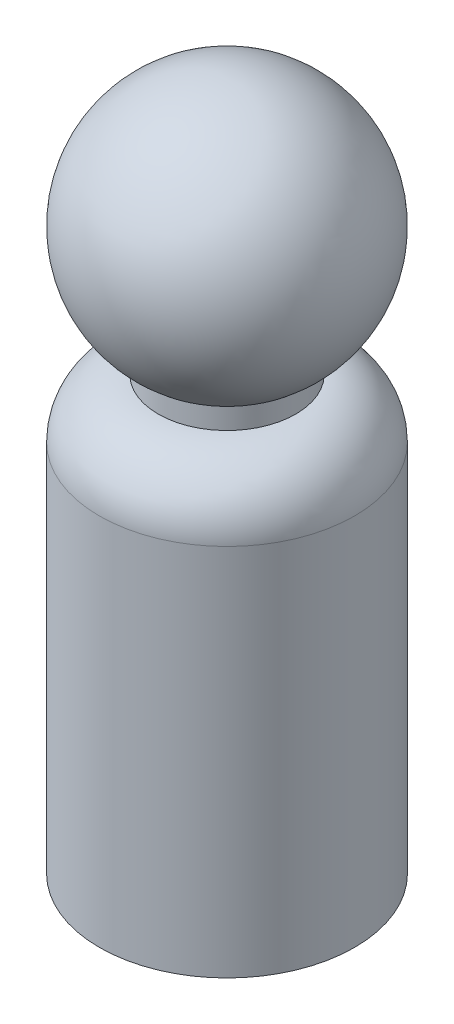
from build123d import *

# Parameters (mm, degrees)
SKETCH1_R           = 11.2395
BOSS_EXTRUDE1_DEPTH = 38.1
FILLET1_R           = 5.1816
SKETCH3_R           = 6.0579
BOSS_EXTRUDE2_DEPTH = 1.8415


with BuildPart() as part:
    # Sketch1 → Boss-Extrude1 (new body)
    with BuildSketch(Plane(origin=(0, 0, 0), x_dir=(1, 0, 0), z_dir=(0, 1, 0))):
        with Locations(Location((0, 0, 0), (0, 0, 90))):
            Circle(SKETCH1_R)
    extrude(amount=BOSS_EXTRUDE1_DEPTH)

    # Fillet1
    fillet1_edges = [part.edges().sort_by_distance(p)[0] for p in [
        (0, 38.1, 11.2395),
    ]]
    fillet(fillet1_edges, radius=FILLET1_R)

    # Sketch3 → Boss-Extrude2 (add)
    with BuildSketch(Plane(origin=(0, 38.1, 0), x_dir=(1, 0, 0), z_dir=(0, 1, 0))):
        with Locations(Location((0, 0, 0), (0, 0, 270))):
            Circle(SKETCH3_R)
    extrude(amount=BOSS_EXTRUDE2_DEPTH)

    # Sketch6 → Revolve4 (revolve)
    with BuildSketch(Plane.XY, mode=Mode.PRIVATE) as revolve4_sk:
        with BuildLine():
            Line((-6.0579, 39.9415), (0, 39.9415))
            Line((0, 39.9415), (0, 60.648217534))
            ThreePointArc((0, 60.648217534), (-10.787334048, 52.564630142), (-6.0579, 39.9415))
        make_face()
    revolve(revolve4_sk.sketch.rotate(Axis((0, 60.648217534, 0), (0, -1, 0)), 270), axis=Axis((0, 60.648217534, 0), (0, -1, 0)))


solid = part.part
